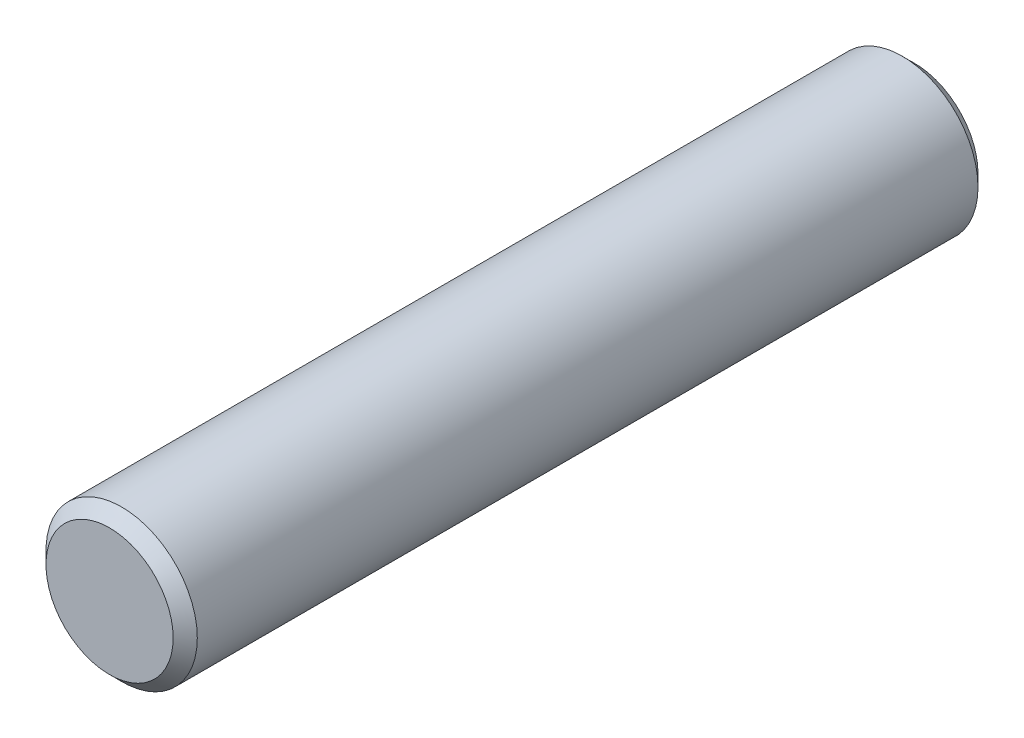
from build123d import *

# Parameters (mm, degrees)
SKETCH1_R           = 2.3876
BOSS_EXTRUDE1_DEPTH = 12.7
CHAMFER1_SIZE       = 0.381


with BuildPart() as part:
    # Sketch1 → Boss-Extrude1 (new, symmetric)
    with BuildSketch(Plane.XY):
        Circle(SKETCH1_R)
    extrude(amount=BOSS_EXTRUDE1_DEPTH, both=True)

    # Chamfer1
    chamfer1_edges = [part.edges().sort_by_distance(p)[0] for p in [
        (-2.3876, 0, -12.7),
        (-2.3876, 0, 12.7),
    ]]
    chamfer(chamfer1_edges, length=CHAMFER1_SIZE)


solid = part.part
